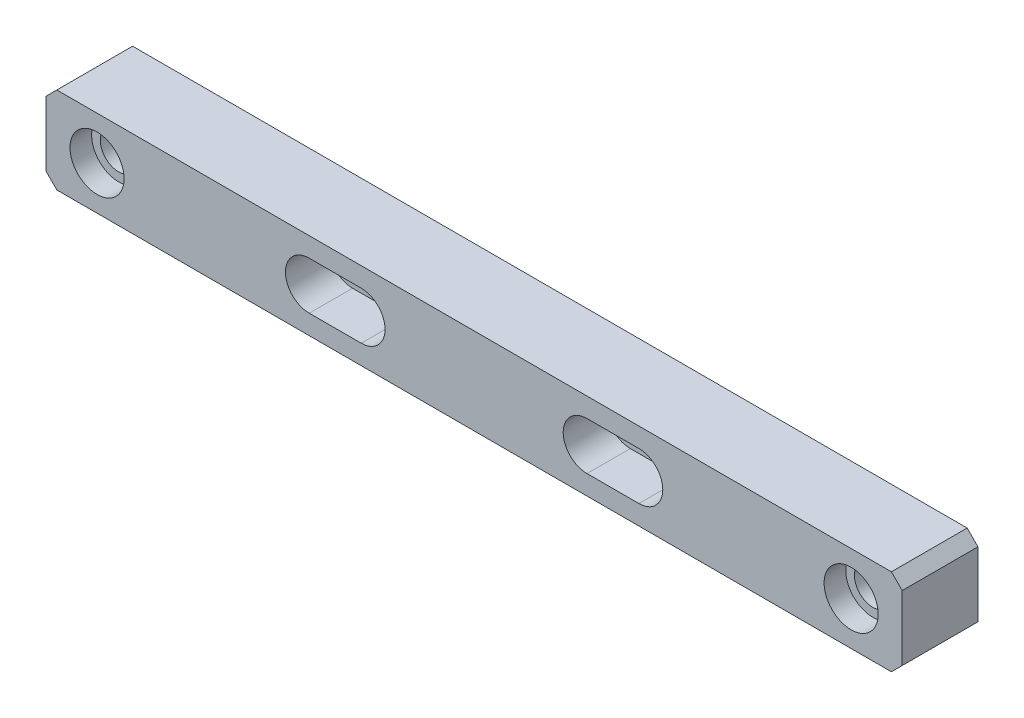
from build123d import *

# Parameters (mm, degrees)
ESQUISSE1_W             = 395.40379246
ESQUISSE1_H             = 40
BOSS_EXTRU_1_DEPTH      = 35
ENL_V_MAT_EXTRU_5_DEPTH = 20
ESQUISSE3_R             = 8.5
ENL_V_MAT_EXTRU_2_DEPTH = 467.531431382
CHANFREIN1_SIZE         = 5
ESQUISSE4_R             = 12.5
ENL_V_MAT_EXTRU_3_DEPTH = 10
ESQUISSE5_R             = 8.5
ENL_V_MAT_EXTRU_4_DEPTH = 466.88794411


with BuildPart() as part:
    # Esquisse1 → Boss.-Extru.1 (new body)
    with BuildSketch(Plane(origin=(0, 0, 126.58572842), x_dir=(-1, 0, 0), z_dir=(0, 0, -1))):
        with Locations((128.720246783, -311.474223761)):
            Rectangle(ESQUISSE1_W, ESQUISSE1_H)
    extrude(amount=BOSS_EXTRU_1_DEPTH)

    # Esquisse7 → Enl_v. mat.-Extru.5 (cut)
    with BuildSketch(Plane.XY.offset(126.58572842)):
        with BuildLine():
            Line((-204.850246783, -300.474223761), (-180.850246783, -300.474223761))
            ThreePointArc((-180.850246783, -300.474223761), (-169.850246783, -311.474223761), (-180.850246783, -322.474223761))
            Line((-180.850246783, -322.474223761), (-204.850246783, -322.474223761))
            ThreePointArc((-204.850246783, -322.474223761), (-215.850246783, -311.474223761), (-204.850246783, -300.474223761))
        make_face()
        with BuildLine():
            Line((-76.590246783, -300.474223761), (-52.590246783, -300.474223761))
            ThreePointArc((-52.590246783, -300.474223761), (-41.590246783, -311.474223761), (-52.590246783, -322.474223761))
            Line((-52.590246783, -322.474223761), (-76.590246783, -322.474223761))
            ThreePointArc((-76.590246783, -322.474223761), (-87.590246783, -311.474223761), (-76.590246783, -300.474223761))
        make_face()
    extrude(amount=-ENL_V_MAT_EXTRU_5_DEPTH, mode=Mode.SUBTRACT)

    # Esquisse3 → Enl_v. mat.-Extru.2 (cut, through all)
    with BuildSketch(Plane(origin=(0, 0, 91.58572842), x_dir=(-1, 0, 0), z_dir=(0, 0, -1))):
        with Locations((64.590246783, -311.474223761)):
            Circle(ESQUISSE3_R)
        with Locations((192.850246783, -311.474223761)):
            Circle(ESQUISSE3_R)
    extrude(amount=-ENL_V_MAT_EXTRU_2_DEPTH, mode=Mode.SUBTRACT)

    # Chanfrein1
    chanfrein1_edges = [part.edges().sort_by_distance(p)[0] for p in [
        (68.981649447, -291.474223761, 109.08572842),
        (-326.422143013, -291.474223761, 109.08572842),
        (-326.422143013, -331.474223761, 109.08572842),
        (68.981649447, -331.474223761, 109.08572842),
    ]]
    chamfer(chanfrein1_edges, length=CHANFREIN1_SIZE)

    # Esquisse4 → Enl_v. mat.-Extru.3 (cut)
    with BuildSketch(Plane.XY.offset(126.58572842)):
        with Locations((-302.850246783, -311.474223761)):
            Circle(ESQUISSE4_R)
        with Locations((45.409753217, -311.474223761)):
            Circle(ESQUISSE4_R)
    extrude(amount=-ENL_V_MAT_EXTRU_3_DEPTH, mode=Mode.SUBTRACT)

    # Esquisse5 → Enl_v. mat.-Extru.4 (cut, through all)
    with BuildSketch(Plane.XY.offset(116.58572842)):
        with Locations((-302.850246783, -311.474223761)):
            Circle(ESQUISSE5_R)
        with Locations((45.409753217, -311.474223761)):
            Circle(ESQUISSE5_R)
    extrude(amount=-ENL_V_MAT_EXTRU_4_DEPTH, mode=Mode.SUBTRACT)


solid = part.part
